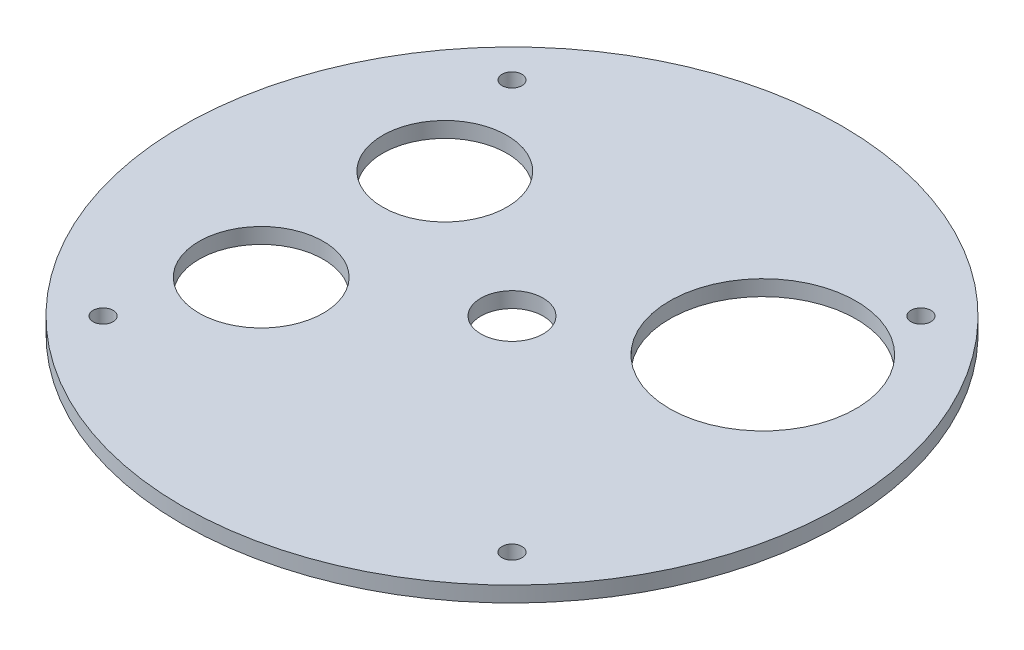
ISO-10303-21;
HEADER;
FILE_DESCRIPTION(('STEP AP214'),'2;1');
FILE_NAME('part.step','',(''),(''),'','','');
FILE_SCHEMA(('AUTOMOTIVE_DESIGN { 1 0 10303 214 1 1 1 1 }'));
ENDSEC;
DATA;
#1=APPLICATION_CONTEXT('core data for automotive mechanical design processes');
#2=APPLICATION_PROTOCOL_DEFINITION('international standard','automotive_design',2000,#1);
#3=PRODUCT_CONTEXT('',#1,'mechanical');
#4=PRODUCT('Part','Part','',(#3));
#5=PRODUCT_RELATED_PRODUCT_CATEGORY('part','',(#4));
#6=PRODUCT_DEFINITION_FORMATION('','',#4);
#7=PRODUCT_DEFINITION_CONTEXT('part definition',#1,'design');
#8=PRODUCT_DEFINITION('design','',#6,#7);
#9=PRODUCT_DEFINITION_SHAPE('','',#8);
#10=(LENGTH_UNIT() NAMED_UNIT(*) SI_UNIT(.MILLI.,.METRE.));
#11=(NAMED_UNIT(*) PLANE_ANGLE_UNIT() SI_UNIT($,.RADIAN.));
#12=(NAMED_UNIT(*) SI_UNIT($,.STERADIAN.) SOLID_ANGLE_UNIT());
#13=UNCERTAINTY_MEASURE_WITH_UNIT(LENGTH_MEASURE(1.E-05),#10,'distance_accuracy_value','');
#14=(GEOMETRIC_REPRESENTATION_CONTEXT(3) GLOBAL_UNCERTAINTY_ASSIGNED_CONTEXT((#13)) GLOBAL_UNIT_ASSIGNED_CONTEXT((#10,
#11,#12)) REPRESENTATION_CONTEXT('',''));
#15=CARTESIAN_POINT('',(0.,0.,0.));
#16=DIRECTION('',(0.,0.,1.));
#17=DIRECTION('',(1.,0.,0.));
#18=AXIS2_PLACEMENT_3D('',#15,#16,#17);
#19=CARTESIAN_POINT('',(0.,3.175,0.));
#20=DIRECTION('',(0.,1.,0.));
#21=DIRECTION('',(0.,0.,1.));
#22=AXIS2_PLACEMENT_3D('',#19,#20,#21);
#23=PLANE('',#22);
#24=CARTESIAN_POINT('',(0.,3.175,0.));
#25=DIRECTION('',(0.,1.,0.));
#26=DIRECTION('',(0.,0.,1.));
#27=AXIS2_PLACEMENT_3D('',#24,#25,#26);
#28=CIRCLE('',#27,6.35);
#29=CARTESIAN_POINT('',(0.,3.175,6.35));
#30=VERTEX_POINT('',#29);
#31=EDGE_CURVE('E109',#30,#30,#28,.T.);
#32=ORIENTED_EDGE('',*,*,#31,.F.);
#33=EDGE_LOOP('',(#32));
#34=FACE_BOUND('',#33,.T.);
#35=CARTESIAN_POINT('',(-32.4759526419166,3.175,18.7499999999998));
#36=DIRECTION('',(0.,1.,0.));
#37=DIRECTION('',(0.,0.,1.));
#38=AXIS2_PLACEMENT_3D('',#35,#36,#37);
#39=CIRCLE('',#38,12.7);
#40=CARTESIAN_POINT('',(-32.4759526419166,3.175,31.4499999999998));
#41=VERTEX_POINT('',#40);
#42=EDGE_CURVE('E77',#41,#41,#39,.T.);
#43=ORIENTED_EDGE('',*,*,#42,.F.);
#44=EDGE_LOOP('',(#43));
#45=FACE_BOUND('',#44,.T.);
#46=CARTESIAN_POINT('',(32.4759526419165,3.175,-18.7499999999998));
#47=DIRECTION('',(0.,1.,0.));
#48=DIRECTION('',(0.,0.,1.));
#49=AXIS2_PLACEMENT_3D('',#46,#47,#48);
#50=CIRCLE('',#49,19.05);
#51=CARTESIAN_POINT('',(32.4759526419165,3.175,0.300000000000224));
#52=VERTEX_POINT('',#51);
#53=EDGE_CURVE('E76',#52,#52,#50,.T.);
#54=ORIENTED_EDGE('',*,*,#53,.F.);
#55=EDGE_LOOP('',(#54));
#56=FACE_BOUND('',#55,.T.);
#57=CARTESIAN_POINT('',(-32.4759526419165,3.175,-18.75));
#58=DIRECTION('',(0.,1.,0.));
#59=DIRECTION('',(0.,0.,1.));
#60=AXIS2_PLACEMENT_3D('',#57,#58,#59);
#61=CIRCLE('',#60,12.7);
#62=CARTESIAN_POINT('',(-32.4759526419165,3.175,-6.05000000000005));
#63=VERTEX_POINT('',#62);
#64=EDGE_CURVE('E70',#63,#63,#61,.T.);
#65=ORIENTED_EDGE('',*,*,#64,.F.);
#66=EDGE_LOOP('',(#65));
#67=FACE_BOUND('',#66,.T.);
#68=CARTESIAN_POINT('',(41.7581909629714,3.175,41.7581909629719));
#69=DIRECTION('',(0.,1.,0.));
#70=DIRECTION('',(0.,0.,1.));
#71=AXIS2_PLACEMENT_3D('',#68,#69,#70);
#72=CIRCLE('',#71,2.032);
#73=CARTESIAN_POINT('',(41.7581909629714,3.175,43.7901909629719));
#74=VERTEX_POINT('',#73);
#75=EDGE_CURVE('E88',#74,#74,#72,.T.);
#76=ORIENTED_EDGE('',*,*,#75,.F.);
#77=EDGE_LOOP('',(#76));
#78=FACE_BOUND('',#77,.T.);
#79=CARTESIAN_POINT('',(-41.7581909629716,3.175,-41.7581909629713));
#80=DIRECTION('',(0.,-1.,0.));
#81=DIRECTION('',(0.,0.,-1.));
#82=AXIS2_PLACEMENT_3D('',#79,#80,#81);
#83=CIRCLE('',#82,2.032);
#84=CARTESIAN_POINT('',(-41.7581909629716,3.175,-43.7901909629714));
#85=VERTEX_POINT('',#84);
#86=EDGE_CURVE('E94',#85,#85,#83,.T.);
#87=ORIENTED_EDGE('',*,*,#86,.T.);
#88=EDGE_LOOP('',(#87));
#89=FACE_BOUND('',#88,.T.);
#90=CARTESIAN_POINT('',(41.7581909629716,3.175,-41.7581909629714));
#91=DIRECTION('',(0.,1.,0.));
#92=DIRECTION('',(0.,0.,1.));
#93=AXIS2_PLACEMENT_3D('',#90,#91,#92);
#94=CIRCLE('',#93,2.032);
#95=CARTESIAN_POINT('',(41.7581909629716,3.175,-39.7261909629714));
#96=VERTEX_POINT('',#95);
#97=EDGE_CURVE('E67',#96,#96,#94,.T.);
#98=ORIENTED_EDGE('',*,*,#97,.F.);
#99=EDGE_LOOP('',(#98));
#100=FACE_BOUND('',#99,.T.);
#101=CARTESIAN_POINT('',(0.,3.175,0.));
#102=DIRECTION('',(0.,1.,0.));
#103=DIRECTION('',(0.,0.,1.));
#104=AXIS2_PLACEMENT_3D('',#101,#102,#103);
#105=CIRCLE('',#104,67.31);
#106=CARTESIAN_POINT('',(0.,3.175,67.31));
#107=VERTEX_POINT('',#106);
#108=EDGE_CURVE('E11',#107,#107,#105,.T.);
#109=ORIENTED_EDGE('',*,*,#108,.T.);
#110=EDGE_LOOP('',(#109));
#111=FACE_BOUND('',#110,.T.);
#112=CARTESIAN_POINT('',(-41.7581909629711,3.175,41.7581909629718));
#113=DIRECTION('',(0.,1.,0.));
#114=DIRECTION('',(0.,0.,1.));
#115=AXIS2_PLACEMENT_3D('',#112,#113,#114);
#116=CIRCLE('',#115,2.032);
#117=CARTESIAN_POINT('',(-41.7581909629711,3.175,43.7901909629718));
#118=VERTEX_POINT('',#117);
#119=EDGE_CURVE('E101',#118,#118,#116,.F.);
#120=ORIENTED_EDGE('',*,*,#119,.T.);
#121=EDGE_LOOP('',(#120));
#122=FACE_BOUND('',#121,.T.);
#123=ADVANCED_FACE('F54',(#34,#45,#56,#67,#78,#89,#100,#111,#122),#23,.T.);
#124=CARTESIAN_POINT('',(0.,0.,0.));
#125=DIRECTION('',(0.,1.,0.));
#126=DIRECTION('',(0.,0.,1.));
#127=AXIS2_PLACEMENT_3D('',#124,#125,#126);
#128=PLANE('',#127);
#129=CARTESIAN_POINT('',(0.,0.,0.));
#130=DIRECTION('',(0.,1.,0.));
#131=DIRECTION('',(0.,0.,1.));
#132=AXIS2_PLACEMENT_3D('',#129,#130,#131);
#133=CIRCLE('',#132,6.35);
#134=CARTESIAN_POINT('',(0.,0.,6.35));
#135=VERTEX_POINT('',#134);
#136=EDGE_CURVE('E95',#135,#135,#133,.T.);
#137=ORIENTED_EDGE('',*,*,#136,.T.);
#138=EDGE_LOOP('',(#137));
#139=FACE_BOUND('',#138,.T.);
#140=CARTESIAN_POINT('',(-32.4759526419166,0.,18.7499999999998));
#141=DIRECTION('',(0.,1.,0.));
#142=DIRECTION('',(0.,0.,1.));
#143=AXIS2_PLACEMENT_3D('',#140,#141,#142);
#144=CIRCLE('',#143,12.7);
#145=CARTESIAN_POINT('',(-32.4759526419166,0.,31.4499999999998));
#146=VERTEX_POINT('',#145);
#147=EDGE_CURVE('E85',#146,#146,#144,.T.);
#148=ORIENTED_EDGE('',*,*,#147,.T.);
#149=EDGE_LOOP('',(#148));
#150=FACE_BOUND('',#149,.T.);
#151=CARTESIAN_POINT('',(32.4759526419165,0.,-18.7499999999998));
#152=DIRECTION('',(0.,1.,0.));
#153=DIRECTION('',(0.,0.,1.));
#154=AXIS2_PLACEMENT_3D('',#151,#152,#153);
#155=CIRCLE('',#154,19.05);
#156=CARTESIAN_POINT('',(32.4759526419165,0.,0.300000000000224));
#157=VERTEX_POINT('',#156);
#158=EDGE_CURVE('E73',#157,#157,#155,.T.);
#159=ORIENTED_EDGE('',*,*,#158,.T.);
#160=EDGE_LOOP('',(#159));
#161=FACE_BOUND('',#160,.T.);
#162=CARTESIAN_POINT('',(-32.4759526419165,0.,-18.75));
#163=DIRECTION('',(0.,1.,0.));
#164=DIRECTION('',(0.,0.,1.));
#165=AXIS2_PLACEMENT_3D('',#162,#163,#164);
#166=CIRCLE('',#165,12.7);
#167=CARTESIAN_POINT('',(-32.4759526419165,0.,-6.05000000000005));
#168=VERTEX_POINT('',#167);
#169=EDGE_CURVE('E80',#168,#168,#166,.T.);
#170=ORIENTED_EDGE('',*,*,#169,.T.);
#171=EDGE_LOOP('',(#170));
#172=FACE_BOUND('',#171,.T.);
#173=CARTESIAN_POINT('',(41.7581909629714,0.,41.7581909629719));
#174=DIRECTION('',(0.,1.,0.));
#175=DIRECTION('',(0.,0.,1.));
#176=AXIS2_PLACEMENT_3D('',#173,#174,#175);
#177=CIRCLE('',#176,2.032);
#178=CARTESIAN_POINT('',(41.7581909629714,0.,43.7901909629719));
#179=VERTEX_POINT('',#178);
#180=EDGE_CURVE('E104',#179,#179,#177,.T.);
#181=ORIENTED_EDGE('',*,*,#180,.T.);
#182=EDGE_LOOP('',(#181));
#183=FACE_BOUND('',#182,.T.);
#184=CARTESIAN_POINT('',(41.7581909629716,0.,-41.7581909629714));
#185=DIRECTION('',(0.,1.,0.));
#186=DIRECTION('',(0.,0.,1.));
#187=AXIS2_PLACEMENT_3D('',#184,#185,#186);
#188=CIRCLE('',#187,2.032);
#189=CARTESIAN_POINT('',(41.7581909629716,0.,-39.7261909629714));
#190=VERTEX_POINT('',#189);
#191=EDGE_CURVE('E65',#190,#190,#188,.T.);
#192=ORIENTED_EDGE('',*,*,#191,.T.);
#193=EDGE_LOOP('',(#192));
#194=FACE_BOUND('',#193,.T.);
#195=CARTESIAN_POINT('',(0.,0.,0.));
#196=DIRECTION('',(0.,1.,0.));
#197=DIRECTION('',(0.,0.,1.));
#198=AXIS2_PLACEMENT_3D('',#195,#196,#197);
#199=CIRCLE('',#198,67.31);
#200=CARTESIAN_POINT('',(0.,0.,67.31));
#201=VERTEX_POINT('',#200);
#202=EDGE_CURVE('E58',#201,#201,#199,.T.);
#203=ORIENTED_EDGE('',*,*,#202,.F.);
#204=EDGE_LOOP('',(#203));
#205=FACE_BOUND('',#204,.T.);
#206=CARTESIAN_POINT('',(-41.7581909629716,0.,-41.7581909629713));
#207=DIRECTION('',(0.,-1.,0.));
#208=DIRECTION('',(0.,0.,-1.));
#209=AXIS2_PLACEMENT_3D('',#206,#207,#208);
#210=CIRCLE('',#209,2.032);
#211=CARTESIAN_POINT('',(-41.7581909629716,0.,-43.7901909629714));
#212=VERTEX_POINT('',#211);
#213=EDGE_CURVE('E91',#212,#212,#210,.T.);
#214=ORIENTED_EDGE('',*,*,#213,.F.);
#215=EDGE_LOOP('',(#214));
#216=FACE_BOUND('',#215,.T.);
#217=CARTESIAN_POINT('',(-41.7581909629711,0.,41.7581909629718));
#218=DIRECTION('',(0.,1.,0.));
#219=DIRECTION('',(0.,0.,1.));
#220=AXIS2_PLACEMENT_3D('',#217,#218,#219);
#221=CIRCLE('',#220,2.032);
#222=CARTESIAN_POINT('',(-41.7581909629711,0.,43.7901909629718));
#223=VERTEX_POINT('',#222);
#224=EDGE_CURVE('E98',#223,#223,#221,.F.);
#225=ORIENTED_EDGE('',*,*,#224,.F.);
#226=EDGE_LOOP('',(#225));
#227=FACE_BOUND('',#226,.T.);
#228=ADVANCED_FACE('F115',(#139,#150,#161,#172,#183,#194,#205,#216,#227),#128,.F.);
#229=CARTESIAN_POINT('',(0.,3.175,0.));
#230=DIRECTION('',(0.,-1.,0.));
#231=DIRECTION('',(0.,0.,-1.));
#232=AXIS2_PLACEMENT_3D('',#229,#230,#231);
#233=CYLINDRICAL_SURFACE('',#232,67.31);
#234=ORIENTED_EDGE('',*,*,#108,.F.);
#235=EDGE_LOOP('',(#234));
#236=FACE_BOUND('',#235,.T.);
#237=ORIENTED_EDGE('',*,*,#202,.T.);
#238=EDGE_LOOP('',(#237));
#239=FACE_BOUND('',#238,.T.);
#240=ADVANCED_FACE('F56',(#236,#239),#233,.T.);
#241=CARTESIAN_POINT('',(41.7581909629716,0.,-41.7581909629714));
#242=DIRECTION('',(0.,1.,0.));
#243=DIRECTION('',(0.,0.,1.));
#244=AXIS2_PLACEMENT_3D('',#241,#242,#243);
#245=CYLINDRICAL_SURFACE('',#244,2.032);
#246=ORIENTED_EDGE('',*,*,#191,.F.);
#247=EDGE_LOOP('',(#246));
#248=FACE_BOUND('',#247,.T.);
#249=ORIENTED_EDGE('',*,*,#97,.T.);
#250=EDGE_LOOP('',(#249));
#251=FACE_BOUND('',#250,.T.);
#252=ADVANCED_FACE('F155',(#248,#251),#245,.F.);
#253=CARTESIAN_POINT('',(-41.7581909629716,0.,-41.7581909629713));
#254=DIRECTION('',(0.,1.,0.));
#255=DIRECTION('',(0.,0.,1.));
#256=AXIS2_PLACEMENT_3D('',#253,#254,#255);
#257=CYLINDRICAL_SURFACE('',#256,2.032);
#258=ORIENTED_EDGE('',*,*,#86,.F.);
#259=EDGE_LOOP('',(#258));
#260=FACE_BOUND('',#259,.T.);
#261=ORIENTED_EDGE('',*,*,#213,.T.);
#262=EDGE_LOOP('',(#261));
#263=FACE_BOUND('',#262,.T.);
#264=ADVANCED_FACE('F145',(#260,#263),#257,.F.);
#265=CARTESIAN_POINT('',(-41.7581909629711,0.,41.7581909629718));
#266=DIRECTION('',(0.,1.,0.));
#267=DIRECTION('',(0.,0.,1.));
#268=AXIS2_PLACEMENT_3D('',#265,#266,#267);
#269=CYLINDRICAL_SURFACE('',#268,2.032);
#270=ORIENTED_EDGE('',*,*,#224,.T.);
#271=EDGE_LOOP('',(#270));
#272=FACE_BOUND('',#271,.T.);
#273=ORIENTED_EDGE('',*,*,#119,.F.);
#274=EDGE_LOOP('',(#273));
#275=FACE_BOUND('',#274,.T.);
#276=ADVANCED_FACE('F142',(#272,#275),#269,.F.);
#277=CARTESIAN_POINT('',(41.7581909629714,0.,41.7581909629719));
#278=DIRECTION('',(0.,1.,0.));
#279=DIRECTION('',(0.,0.,1.));
#280=AXIS2_PLACEMENT_3D('',#277,#278,#279);
#281=CYLINDRICAL_SURFACE('',#280,2.032);
#282=ORIENTED_EDGE('',*,*,#180,.F.);
#283=EDGE_LOOP('',(#282));
#284=FACE_BOUND('',#283,.T.);
#285=ORIENTED_EDGE('',*,*,#75,.T.);
#286=EDGE_LOOP('',(#285));
#287=FACE_BOUND('',#286,.T.);
#288=ADVANCED_FACE('F144',(#284,#287),#281,.F.);
#289=CARTESIAN_POINT('',(-32.4759526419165,0.,-18.75));
#290=DIRECTION('',(0.,1.,0.));
#291=DIRECTION('',(0.,0.,1.));
#292=AXIS2_PLACEMENT_3D('',#289,#290,#291);
#293=CYLINDRICAL_SURFACE('',#292,12.7);
#294=ORIENTED_EDGE('',*,*,#64,.T.);
#295=EDGE_LOOP('',(#294));
#296=FACE_BOUND('',#295,.T.);
#297=ORIENTED_EDGE('',*,*,#169,.F.);
#298=EDGE_LOOP('',(#297));
#299=FACE_BOUND('',#298,.T.);
#300=ADVANCED_FACE('F152',(#296,#299),#293,.F.);
#301=CARTESIAN_POINT('',(32.4759526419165,0.,-18.7499999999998));
#302=DIRECTION('',(0.,1.,0.));
#303=DIRECTION('',(0.,0.,1.));
#304=AXIS2_PLACEMENT_3D('',#301,#302,#303);
#305=CYLINDRICAL_SURFACE('',#304,19.05);
#306=ORIENTED_EDGE('',*,*,#158,.F.);
#307=EDGE_LOOP('',(#306));
#308=FACE_BOUND('',#307,.T.);
#309=ORIENTED_EDGE('',*,*,#53,.T.);
#310=EDGE_LOOP('',(#309));
#311=FACE_BOUND('',#310,.T.);
#312=ADVANCED_FACE('F161',(#308,#311),#305,.F.);
#313=CARTESIAN_POINT('',(-32.4759526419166,0.,18.7499999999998));
#314=DIRECTION('',(0.,1.,0.));
#315=DIRECTION('',(0.,0.,1.));
#316=AXIS2_PLACEMENT_3D('',#313,#314,#315);
#317=CYLINDRICAL_SURFACE('',#316,12.7);
#318=ORIENTED_EDGE('',*,*,#147,.F.);
#319=EDGE_LOOP('',(#318));
#320=FACE_BOUND('',#319,.T.);
#321=ORIENTED_EDGE('',*,*,#42,.T.);
#322=EDGE_LOOP('',(#321));
#323=FACE_BOUND('',#322,.T.);
#324=ADVANCED_FACE('F121',(#320,#323),#317,.F.);
#325=CARTESIAN_POINT('',(0.,0.,0.));
#326=DIRECTION('',(0.,1.,0.));
#327=DIRECTION('',(0.,0.,1.));
#328=AXIS2_PLACEMENT_3D('',#325,#326,#327);
#329=CYLINDRICAL_SURFACE('',#328,6.35);
#330=ORIENTED_EDGE('',*,*,#136,.F.);
#331=EDGE_LOOP('',(#330));
#332=FACE_BOUND('',#331,.T.);
#333=ORIENTED_EDGE('',*,*,#31,.T.);
#334=EDGE_LOOP('',(#333));
#335=FACE_BOUND('',#334,.T.);
#336=ADVANCED_FACE('F118',(#332,#335),#329,.F.);
#337=CLOSED_SHELL('',(#123,#228,#240,#252,#264,#276,#288,#300,#312,#324,#336));
#338=MANIFOLD_SOLID_BREP('B2',#337);
#339=ADVANCED_BREP_SHAPE_REPRESENTATION('',(#18,#338),#14);
#340=SHAPE_DEFINITION_REPRESENTATION(#9,#339);
ENDSEC;
END-ISO-10303-21;
